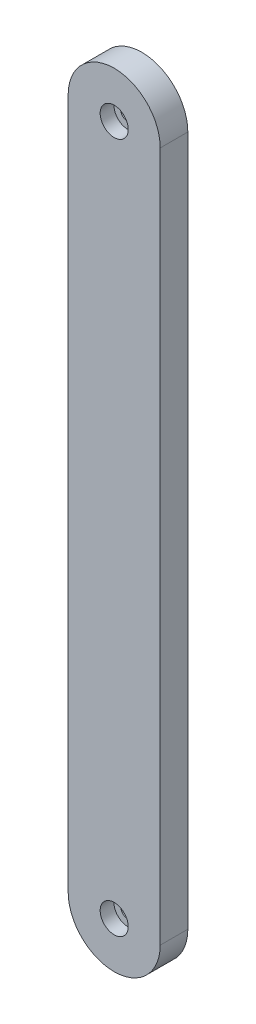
from build123d import *

# Parameters (mm, degrees)
SKETCH1_R           = 1.6
BOSS_EXTRUDE1_DEPTH = 6
SKETCH2_R           = 3.05
CUT_EXTRUDE1_DEPTH  = 3


with BuildPart() as part:
    # Sketch1 → Boss-Extrude1 (new body)
    with BuildSketch(Plane.XY):
        with BuildLine():
            Line((-10, 0), (-10, 150))
            ThreePointArc((-10, 150), (0, 160), (10, 150))
            Line((10, 150), (10, 0))
            ThreePointArc((10, 0), (0, -10), (-10, 0))
        make_face()
        Circle(SKETCH1_R, mode=Mode.SUBTRACT)
        with Locations((0, 150)):
            Circle(SKETCH1_R, mode=Mode.SUBTRACT)
    extrude(amount=BOSS_EXTRUDE1_DEPTH)

    # Sketch2 → Cut-Extrude1 (cut)
    with BuildSketch(Plane.XY.offset(6)):
        with Locations((0, 150)):
            Circle(SKETCH2_R)
        Circle(SKETCH2_R)
    extrude(amount=-CUT_EXTRUDE1_DEPTH, mode=Mode.SUBTRACT)


solid = part.part
